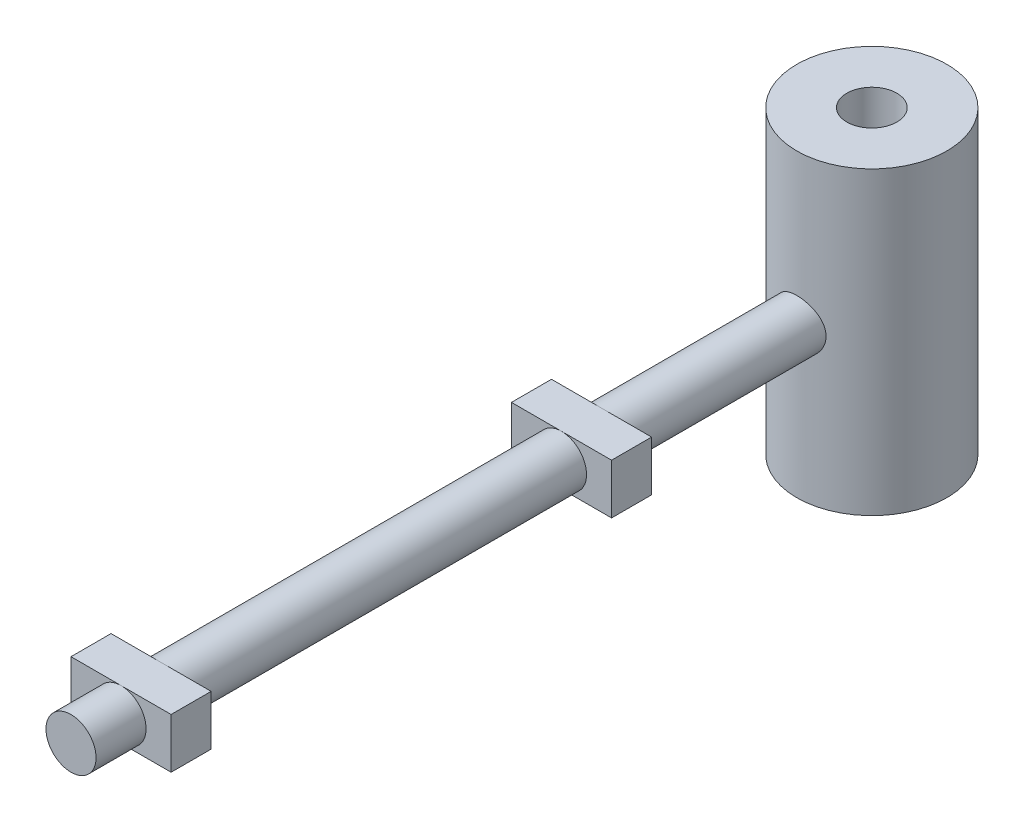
ISO-10303-21;
HEADER;
FILE_DESCRIPTION(('STEP AP214'),'2;1');
FILE_NAME('part.step','',(''),(''),'','','');
FILE_SCHEMA(('AUTOMOTIVE_DESIGN { 1 0 10303 214 1 1 1 1 }'));
ENDSEC;
DATA;
#1=APPLICATION_CONTEXT('core data for automotive mechanical design processes');
#2=APPLICATION_PROTOCOL_DEFINITION('international standard','automotive_design',2000,#1);
#3=PRODUCT_CONTEXT('',#1,'mechanical');
#4=PRODUCT('Part','Part','',(#3));
#5=PRODUCT_RELATED_PRODUCT_CATEGORY('part','',(#4));
#6=PRODUCT_DEFINITION_FORMATION('','',#4);
#7=PRODUCT_DEFINITION_CONTEXT('part definition',#1,'design');
#8=PRODUCT_DEFINITION('design','',#6,#7);
#9=PRODUCT_DEFINITION_SHAPE('','',#8);
#10=(LENGTH_UNIT() NAMED_UNIT(*) SI_UNIT(.MILLI.,.METRE.));
#11=(NAMED_UNIT(*) PLANE_ANGLE_UNIT() SI_UNIT($,.RADIAN.));
#12=(NAMED_UNIT(*) SI_UNIT($,.STERADIAN.) SOLID_ANGLE_UNIT());
#13=UNCERTAINTY_MEASURE_WITH_UNIT(LENGTH_MEASURE(1.E-05),#10,'distance_accuracy_value','');
#14=(GEOMETRIC_REPRESENTATION_CONTEXT(3) GLOBAL_UNCERTAINTY_ASSIGNED_CONTEXT((#13)) GLOBAL_UNIT_ASSIGNED_CONTEXT((#10,
#11,#12)) REPRESENTATION_CONTEXT('',''));
#15=CARTESIAN_POINT('',(0.,0.,0.));
#16=DIRECTION('',(0.,0.,1.));
#17=DIRECTION('',(1.,0.,0.));
#18=AXIS2_PLACEMENT_3D('',#15,#16,#17);
#19=CARTESIAN_POINT('',(0.,0.,-75.));
#20=DIRECTION('',(0.,0.,1.));
#21=DIRECTION('',(1.,0.,0.));
#22=AXIS2_PLACEMENT_3D('',#19,#20,#21);
#23=CYLINDRICAL_SURFACE('',#22,2.5);
#24=CARTESIAN_POINT('',(0.,0.,-48.));
#25=DIRECTION('',(0.,0.,-1.));
#26=DIRECTION('',(-1.,0.,0.));
#27=AXIS2_PLACEMENT_3D('',#24,#25,#26);
#28=CIRCLE('',#27,2.5);
#29=CARTESIAN_POINT('',(0.,2.5,-48.));
#30=VERTEX_POINT('',#29);
#31=CARTESIAN_POINT('',(0.,-2.5,-48.));
#32=VERTEX_POINT('',#31);
#33=EDGE_CURVE('E140',#30,#32,#28,.T.);
#34=ORIENTED_EDGE('',*,*,#33,.T.);
#35=EDGE_CURVE('E41',#32,#30,#28,.T.);
#36=ORIENTED_EDGE('',*,*,#35,.T.);
#37=EDGE_LOOP('',(#34,#36));
#38=FACE_BOUND('',#37,.T.);
#39=CARTESIAN_POINT('',(2.5,0.,-67.9289321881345));
#40=CARTESIAN_POINT('',(2.50000064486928,-0.13617043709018,-67.9289326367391));
#41=CARTESIAN_POINT('',(2.48883695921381,-0.272336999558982,-67.9249557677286));
#42=CARTESIAN_POINT('',(2.44462782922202,-0.540636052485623,-67.9095606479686));
#43=CARTESIAN_POINT('',(2.41157878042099,-0.672767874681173,-67.8981411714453));
#44=CARTESIAN_POINT('',(2.32488871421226,-0.92906723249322,-67.8692949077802));
#45=CARTESIAN_POINT('',(2.27128805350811,-1.05324982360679,-67.851879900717));
#46=CARTESIAN_POINT('',(2.14515407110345,-1.2909001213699,-67.8130219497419));
#47=CARTESIAN_POINT('',(2.07261657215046,-1.40436545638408,-67.7915781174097));
#48=CARTESIAN_POINT('',(1.90762786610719,-1.62179990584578,-67.7461377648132));
#49=CARTESIAN_POINT('',(1.8145608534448,-1.72528857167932,-67.7220776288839));
#50=CARTESIAN_POINT('',(1.61246916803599,-1.9155170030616,-67.6746533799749));
#51=CARTESIAN_POINT('',(1.50344193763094,-2.00225407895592,-67.651289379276));
#52=CARTESIAN_POINT('',(1.26901126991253,-2.15869724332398,-67.607153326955));
#53=CARTESIAN_POINT('',(1.14325477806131,-2.2278999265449,-67.5864648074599));
#54=CARTESIAN_POINT('',(0.881078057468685,-2.34397896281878,-67.5507603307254));
#55=CARTESIAN_POINT('',(0.74466071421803,-2.39086133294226,-67.5357428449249));
#56=CARTESIAN_POINT('',(0.470072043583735,-2.45933963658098,-67.5135231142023));
#57=CARTESIAN_POINT('',(0.332126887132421,-2.48175861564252,-67.506067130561));
#58=CARTESIAN_POINT('',(0.0542446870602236,-2.50329073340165,-67.4989097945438));
#59=CARTESIAN_POINT('',(-0.0856918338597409,-2.50240987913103,-67.4992064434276));
#60=CARTESIAN_POINT('',(-0.357758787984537,-2.47788936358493,-67.5073490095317));
#61=CARTESIAN_POINT('',(-0.489980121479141,-2.45514367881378,-67.5148983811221));
#62=CARTESIAN_POINT('',(-0.748608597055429,-2.38901754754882,-67.5363258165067));
#63=CARTESIAN_POINT('',(-0.87501534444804,-2.34563570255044,-67.5502043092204));
#64=CARTESIAN_POINT('',(-1.12038118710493,-2.23894670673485,-67.5831082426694));
#65=CARTESIAN_POINT('',(-1.23922055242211,-2.17538515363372,-67.6021989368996));
#66=CARTESIAN_POINT('',(-1.46481081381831,-2.03035073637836,-67.643540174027));
#67=CARTESIAN_POINT('',(-1.57155833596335,-1.94887289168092,-67.6657915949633));
#68=CARTESIAN_POINT('',(-1.77525216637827,-1.76581401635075,-67.7123452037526));
#69=CARTESIAN_POINT('',(-1.87150039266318,-1.6634671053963,-67.7366946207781));
#70=CARTESIAN_POINT('',(-2.04569314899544,-1.44387818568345,-67.7838166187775));
#71=CARTESIAN_POINT('',(-2.12363485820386,-1.32663388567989,-67.8065889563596));
#72=CARTESIAN_POINT('',(-2.25996863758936,-1.0783659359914,-67.8482368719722));
#73=CARTESIAN_POINT('',(-2.31806615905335,-0.947169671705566,-67.8670522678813));
#74=CARTESIAN_POINT('',(-2.41110798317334,-0.676071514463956,-67.8979587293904));
#75=CARTESIAN_POINT('',(-2.44606198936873,-0.536173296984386,-67.9100526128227));
#76=CARTESIAN_POINT('',(-2.4904032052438,-0.258404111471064,-67.9255090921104));
#77=CARTESIAN_POINT('',(-2.50087273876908,-0.12072643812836,-67.9292409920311));
#78=CARTESIAN_POINT('',(-2.4990135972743,0.154440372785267,-67.9285831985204));
#79=CARTESIAN_POINT('',(-2.48668906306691,0.291929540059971,-67.9241949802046));
#80=CARTESIAN_POINT('',(-2.44056412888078,0.557892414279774,-67.9081595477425));
#81=CARTESIAN_POINT('',(-2.40751598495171,0.686513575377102,-67.896766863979));
#82=CARTESIAN_POINT('',(-2.32178465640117,0.936359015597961,-67.8682861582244));
#83=CARTESIAN_POINT('',(-2.26909799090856,1.05758197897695,-67.851197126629));
#84=CARTESIAN_POINT('',(-2.14368585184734,1.29345105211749,-67.8125780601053));
#85=CARTESIAN_POINT('',(-2.07037779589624,1.4077666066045,-67.7909243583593));
#86=CARTESIAN_POINT('',(-1.9064640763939,1.6228651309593,-67.7458557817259));
#87=CARTESIAN_POINT('',(-1.81585331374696,1.72364409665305,-67.7224403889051));
#88=CARTESIAN_POINT('',(-1.61472926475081,1.9138199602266,-67.6751240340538));
#89=CARTESIAN_POINT('',(-1.50346817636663,2.00243597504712,-67.6512539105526));
#90=CARTESIAN_POINT('',(-1.26706822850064,2.15979035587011,-67.6068287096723));
#91=CARTESIAN_POINT('',(-1.14192986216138,2.22852942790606,-67.5862735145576));
#92=CARTESIAN_POINT('',(-0.88194965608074,2.34355026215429,-67.5508898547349));
#93=CARTESIAN_POINT('',(-0.747177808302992,2.38997819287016,-67.5360242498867));
#94=CARTESIAN_POINT('',(-0.471146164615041,2.45931935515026,-67.5135347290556));
#95=CARTESIAN_POINT('',(-0.329888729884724,2.48224107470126,-67.5059081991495));
#96=CARTESIAN_POINT('',(-0.0520383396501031,2.50315519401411,-67.4989534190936));
#97=CARTESIAN_POINT('',(0.0844618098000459,2.50226863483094,-67.499251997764));
#98=CARTESIAN_POINT('',(0.355277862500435,2.47835672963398,-67.507195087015));
#99=CARTESIAN_POINT('',(0.489593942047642,2.45533317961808,-67.5148390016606));
#100=CARTESIAN_POINT('',(0.750105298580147,2.38854441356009,-67.5364771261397));
#101=CARTESIAN_POINT('',(0.876395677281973,2.34511446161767,-67.5503685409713));
#102=CARTESIAN_POINT('',(1.11994587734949,2.23905617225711,-67.5830709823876));
#103=CARTESIAN_POINT('',(1.23720406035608,2.17642436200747,-67.6018828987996));
#104=CARTESIAN_POINT('',(1.46408504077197,2.03107621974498,-67.643353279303));
#105=CARTESIAN_POINT('',(1.57326562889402,1.9477032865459,-67.6661281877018));
#106=CARTESIAN_POINT('',(1.77645256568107,1.76435652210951,-67.712675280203));
#107=CARTESIAN_POINT('',(1.87045405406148,1.66437739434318,-67.7364477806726));
#108=CARTESIAN_POINT('',(2.0443545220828,1.44597661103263,-67.78341800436));
#109=CARTESIAN_POINT('',(2.12355741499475,1.3269862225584,-67.8065568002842));
#110=CARTESIAN_POINT('',(2.26078585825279,1.07666393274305,-67.8484951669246));
#111=CARTESIAN_POINT('',(2.31881694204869,0.945335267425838,-67.8672958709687));
#112=CARTESIAN_POINT('',(2.40960957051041,0.68009543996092,-67.8974666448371));
#113=CARTESIAN_POINT('',(2.4433947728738,0.546569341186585,-67.9091341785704));
#114=CARTESIAN_POINT('',(2.48858580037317,0.275359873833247,-67.924865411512));
#115=CARTESIAN_POINT('',(2.49999934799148,0.137677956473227,-67.9289317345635));
#116=CARTESIAN_POINT('',(2.5,0.,-67.9289321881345));
#117=B_SPLINE_CURVE_WITH_KNOTS('',3,(#39,#40,#41,#42,#43,#44,#45,#46,#47,#48,#49,#50,#51,#52,
#53,#54,#55,#56,#57,#58,#59,#60,#61,#62,#63,#64,#65,#66,#67,#68,#69,#70,#71,#72,#73,#74,#75,#76,
#77,#78,#79,#80,#81,#82,#83,#84,#85,#86,#87,#88,#89,#90,#91,#92,#93,#94,#95,#96,#97,#98,#99,
#100,#101,#102,#103,#104,#105,#106,#107,#108,#109,#110,#111,#112,#113,#114,#115,#116),
.UNSPECIFIED.,.T.,.F.,(4,2,2,2,2,2,2,2,2,2,2,2,2,2,2,2,2,2,2,2,2,2,2,2,2,2,2,2,2,2,2,2,2,2,2,2,
2,2,4),(0.,0.40800146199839,0.816070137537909,1.22334156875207,1.6307029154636,2.0525334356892,
2.4744316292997,2.90733765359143,3.34012690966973,3.75785796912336,4.17548133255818,
4.57672512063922,4.97799610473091,5.38454137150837,5.79119979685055,6.21700435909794,
6.64287449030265,7.07481599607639,7.50657628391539,7.91885728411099,8.33106339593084,
8.7291098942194,9.12722697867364,9.53797144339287,9.94883714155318,10.3794702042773,
10.8100879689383,11.2378447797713,11.6654470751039,12.0729521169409,12.4804241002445,
12.8814239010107,13.2824962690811,13.6983879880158,14.1144126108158,14.5467225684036,
14.9789194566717,15.3915803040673,15.8040986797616),.UNSPECIFIED.);
#118=CARTESIAN_POINT('',(2.5,0.,-67.9289321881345));
#119=VERTEX_POINT('',#118);
#120=EDGE_CURVE('E11',#119,#119,#117,.T.);
#121=ORIENTED_EDGE('',*,*,#120,.F.);
#122=EDGE_LOOP('',(#121));
#123=FACE_BOUND('',#122,.T.);
#124=ADVANCED_FACE('F32',(#38,#123),#23,.T.);
#125=CARTESIAN_POINT('',(5.,-2.5,-48.));
#126=DIRECTION('',(0.,0.,-1.));
#127=DIRECTION('',(-1.,0.,0.));
#128=AXIS2_PLACEMENT_3D('',#125,#126,#127);
#129=PLANE('',#128);
#130=ORIENTED_EDGE('',*,*,#33,.F.);
#131=DIRECTION('',(1.,0.,0.));
#132=VECTOR('',#131,1.);
#133=CARTESIAN_POINT('',(5.,2.5,-48.));
#134=LINE('',#133,#132);
#135=CARTESIAN_POINT('',(5.,2.5,-48.));
#136=VERTEX_POINT('',#135);
#137=EDGE_CURVE('E128',#30,#136,#134,.T.);
#138=ORIENTED_EDGE('',*,*,#137,.T.);
#139=DIRECTION('',(0.,-1.,0.));
#140=VECTOR('',#139,1.);
#141=CARTESIAN_POINT('',(5.,2.5,-48.));
#142=LINE('',#141,#140);
#143=CARTESIAN_POINT('',(5.,-2.5,-48.));
#144=VERTEX_POINT('',#143);
#145=EDGE_CURVE('E167',#136,#144,#142,.T.);
#146=ORIENTED_EDGE('',*,*,#145,.T.);
#147=DIRECTION('',(-1.,0.,0.));
#148=VECTOR('',#147,1.);
#149=CARTESIAN_POINT('',(5.,-2.5,-48.));
#150=LINE('',#149,#148);
#151=EDGE_CURVE('E142',#144,#32,#150,.T.);
#152=ORIENTED_EDGE('',*,*,#151,.T.);
#153=EDGE_LOOP('',(#130,#138,#146,#152));
#154=FACE_BOUND('',#153,.T.);
#155=ADVANCED_FACE('F141',(#154),#129,.T.);
#156=CARTESIAN_POINT('',(5.,2.5,-4.));
#157=DIRECTION('',(0.,0.,-1.));
#158=DIRECTION('',(-1.,0.,0.));
#159=AXIS2_PLACEMENT_3D('',#156,#157,#158);
#160=PLANE('',#159);
#161=CARTESIAN_POINT('',(0.,0.,-4.));
#162=DIRECTION('',(0.,0.,-1.));
#163=DIRECTION('',(-1.,0.,0.));
#164=AXIS2_PLACEMENT_3D('',#161,#162,#163);
#165=CIRCLE('',#164,2.5);
#166=CARTESIAN_POINT('',(0.,2.5,-4.));
#167=VERTEX_POINT('',#166);
#168=CARTESIAN_POINT('',(0.,-2.5,-4.));
#169=VERTEX_POINT('',#168);
#170=EDGE_CURVE('E152',#167,#169,#165,.T.);
#171=ORIENTED_EDGE('',*,*,#170,.F.);
#172=DIRECTION('',(1.,0.,0.));
#173=VECTOR('',#172,1.);
#174=CARTESIAN_POINT('',(5.,2.5,-4.));
#175=LINE('',#174,#173);
#176=CARTESIAN_POINT('',(5.,2.5,-4.));
#177=VERTEX_POINT('',#176);
#178=EDGE_CURVE('E205',#167,#177,#175,.T.);
#179=ORIENTED_EDGE('',*,*,#178,.T.);
#180=DIRECTION('',(0.,-1.,0.));
#181=VECTOR('',#180,1.);
#182=CARTESIAN_POINT('',(5.,2.5,-4.));
#183=LINE('',#182,#181);
#184=CARTESIAN_POINT('',(5.,-2.5,-4.));
#185=VERTEX_POINT('',#184);
#186=EDGE_CURVE('E196',#177,#185,#183,.T.);
#187=ORIENTED_EDGE('',*,*,#186,.T.);
#188=DIRECTION('',(-1.,0.,0.));
#189=VECTOR('',#188,1.);
#190=CARTESIAN_POINT('',(5.,-2.5,-4.));
#191=LINE('',#190,#189);
#192=EDGE_CURVE('E200',#185,#169,#191,.T.);
#193=ORIENTED_EDGE('',*,*,#192,.T.);
#194=EDGE_LOOP('',(#171,#179,#187,#193));
#195=FACE_BOUND('',#194,.T.);
#196=ADVANCED_FACE('F255',(#195),#160,.T.);
#197=CARTESIAN_POINT('',(0.,0.,5.));
#198=DIRECTION('',(0.,0.,-1.));
#199=DIRECTION('',(-1.,0.,0.));
#200=AXIS2_PLACEMENT_3D('',#197,#198,#199);
#201=CYLINDRICAL_SURFACE('',#200,2.5);
#202=CARTESIAN_POINT('',(0.,0.,5.));
#203=DIRECTION('',(0.,0.,1.));
#204=DIRECTION('',(1.,0.,0.));
#205=AXIS2_PLACEMENT_3D('',#202,#203,#204);
#206=CIRCLE('',#205,2.5);
#207=CARTESIAN_POINT('',(2.5,0.,5.));
#208=VERTEX_POINT('',#207);
#209=EDGE_CURVE('E150',#208,#208,#206,.T.);
#210=ORIENTED_EDGE('',*,*,#209,.F.);
#211=EDGE_LOOP('',(#210));
#212=FACE_BOUND('',#211,.T.);
#213=CARTESIAN_POINT('',(0.,0.,0.));
#214=DIRECTION('',(0.,0.,1.));
#215=DIRECTION('',(1.,0.,0.));
#216=AXIS2_PLACEMENT_3D('',#213,#214,#215);
#217=CIRCLE('',#216,2.5);
#218=CARTESIAN_POINT('',(0.,2.5,0.));
#219=VERTEX_POINT('',#218);
#220=CARTESIAN_POINT('',(0.,-2.5,0.));
#221=VERTEX_POINT('',#220);
#222=EDGE_CURVE('E221',#219,#221,#217,.T.);
#223=ORIENTED_EDGE('',*,*,#222,.T.);
#224=EDGE_CURVE('E220',#221,#219,#217,.T.);
#225=ORIENTED_EDGE('',*,*,#224,.T.);
#226=EDGE_LOOP('',(#223,#225));
#227=FACE_BOUND('',#226,.T.);
#228=ADVANCED_FACE('F34',(#212,#227),#201,.T.);
#229=CARTESIAN_POINT('',(0.,0.,5.));
#230=DIRECTION('',(0.,0.,1.));
#231=DIRECTION('',(1.,0.,0.));
#232=AXIS2_PLACEMENT_3D('',#229,#230,#231);
#233=PLANE('',#232);
#234=ORIENTED_EDGE('',*,*,#209,.T.);
#235=EDGE_LOOP('',(#234));
#236=FACE_BOUND('',#235,.T.);
#237=ADVANCED_FACE('F311',(#236),#233,.T.);
#238=CARTESIAN_POINT('',(5.,2.5,0.));
#239=DIRECTION('',(0.,0.,-1.));
#240=DIRECTION('',(-1.,0.,0.));
#241=AXIS2_PLACEMENT_3D('',#238,#239,#240);
#242=PLANE('',#241);
#243=ORIENTED_EDGE('',*,*,#222,.F.);
#244=DIRECTION('',(1.,0.,0.));
#245=VECTOR('',#244,1.);
#246=CARTESIAN_POINT('',(5.,2.5,0.));
#247=LINE('',#246,#245);
#248=CARTESIAN_POINT('',(-5.,2.5,0.));
#249=VERTEX_POINT('',#248);
#250=EDGE_CURVE('E194',#249,#219,#247,.T.);
#251=ORIENTED_EDGE('',*,*,#250,.F.);
#252=DIRECTION('',(0.,1.,0.));
#253=VECTOR('',#252,1.);
#254=CARTESIAN_POINT('',(-5.,2.5,0.));
#255=LINE('',#254,#253);
#256=CARTESIAN_POINT('',(-5.,-2.5,0.));
#257=VERTEX_POINT('',#256);
#258=EDGE_CURVE('E191',#257,#249,#255,.T.);
#259=ORIENTED_EDGE('',*,*,#258,.F.);
#260=DIRECTION('',(-1.,0.,0.));
#261=VECTOR('',#260,1.);
#262=CARTESIAN_POINT('',(5.,-2.5,0.));
#263=LINE('',#262,#261);
#264=EDGE_CURVE('E187',#221,#257,#263,.T.);
#265=ORIENTED_EDGE('',*,*,#264,.F.);
#266=EDGE_LOOP('',(#243,#251,#259,#265));
#267=FACE_BOUND('',#266,.T.);
#268=ADVANCED_FACE('F292',(#267),#242,.F.);
#269=CARTESIAN_POINT('',(5.,2.5,-4.));
#270=DIRECTION('',(-1.,0.,0.));
#271=DIRECTION('',(0.,-1.,0.));
#272=AXIS2_PLACEMENT_3D('',#269,#270,#271);
#273=PLANE('',#272);
#274=DIRECTION('',(0.,-1.,0.));
#275=VECTOR('',#274,1.);
#276=CARTESIAN_POINT('',(5.,2.5,0.));
#277=LINE('',#276,#275);
#278=CARTESIAN_POINT('',(5.,2.5,0.));
#279=VERTEX_POINT('',#278);
#280=CARTESIAN_POINT('',(5.,-2.5,0.));
#281=VERTEX_POINT('',#280);
#282=EDGE_CURVE('E184',#279,#281,#277,.T.);
#283=ORIENTED_EDGE('',*,*,#282,.T.);
#284=DIRECTION('',(0.,0.,1.));
#285=VECTOR('',#284,1.);
#286=CARTESIAN_POINT('',(5.,-2.5,-4.));
#287=LINE('',#286,#285);
#288=EDGE_CURVE('E217',#185,#281,#287,.T.);
#289=ORIENTED_EDGE('',*,*,#288,.F.);
#290=ORIENTED_EDGE('',*,*,#186,.F.);
#291=DIRECTION('',(0.,0.,1.));
#292=VECTOR('',#291,1.);
#293=CARTESIAN_POINT('',(5.,2.5,-4.));
#294=LINE('',#293,#292);
#295=EDGE_CURVE('E208',#177,#279,#294,.T.);
#296=ORIENTED_EDGE('',*,*,#295,.T.);
#297=EDGE_LOOP('',(#283,#289,#290,#296));
#298=FACE_BOUND('',#297,.T.);
#299=ADVANCED_FACE('F307',(#298),#273,.F.);
#300=CARTESIAN_POINT('',(5.,-2.5,-4.));
#301=DIRECTION('',(0.,1.,0.));
#302=DIRECTION('',(-1.,0.,0.));
#303=AXIS2_PLACEMENT_3D('',#300,#301,#302);
#304=PLANE('',#303);
#305=EDGE_CURVE('E188',#281,#221,#263,.T.);
#306=ORIENTED_EDGE('',*,*,#305,.T.);
#307=ORIENTED_EDGE('',*,*,#264,.T.);
#308=DIRECTION('',(0.,0.,1.));
#309=VECTOR('',#308,1.);
#310=CARTESIAN_POINT('',(-5.,-2.5,-4.));
#311=LINE('',#310,#309);
#312=CARTESIAN_POINT('',(-5.,-2.5,-4.));
#313=VERTEX_POINT('',#312);
#314=EDGE_CURVE('E214',#313,#257,#311,.T.);
#315=ORIENTED_EDGE('',*,*,#314,.F.);
#316=EDGE_CURVE('E199',#169,#313,#191,.T.);
#317=ORIENTED_EDGE('',*,*,#316,.F.);
#318=ORIENTED_EDGE('',*,*,#192,.F.);
#319=ORIENTED_EDGE('',*,*,#288,.T.);
#320=EDGE_LOOP('',(#306,#307,#315,#317,#318,#319));
#321=FACE_BOUND('',#320,.T.);
#322=ADVANCED_FACE('F303',(#321),#304,.F.);
#323=CARTESIAN_POINT('',(-5.,2.5,-4.));
#324=DIRECTION('',(1.,0.,0.));
#325=DIRECTION('',(0.,1.,0.));
#326=AXIS2_PLACEMENT_3D('',#323,#324,#325);
#327=PLANE('',#326);
#328=ORIENTED_EDGE('',*,*,#258,.T.);
#329=DIRECTION('',(0.,0.,1.));
#330=VECTOR('',#329,1.);
#331=CARTESIAN_POINT('',(-5.,2.5,-4.));
#332=LINE('',#331,#330);
#333=CARTESIAN_POINT('',(-5.,2.5,-4.));
#334=VERTEX_POINT('',#333);
#335=EDGE_CURVE('E211',#334,#249,#332,.T.);
#336=ORIENTED_EDGE('',*,*,#335,.F.);
#337=DIRECTION('',(0.,1.,0.));
#338=VECTOR('',#337,1.);
#339=CARTESIAN_POINT('',(-5.,2.5,-4.));
#340=LINE('',#339,#338);
#341=EDGE_CURVE('E203',#313,#334,#340,.T.);
#342=ORIENTED_EDGE('',*,*,#341,.F.);
#343=ORIENTED_EDGE('',*,*,#314,.T.);
#344=EDGE_LOOP('',(#328,#336,#342,#343));
#345=FACE_BOUND('',#344,.T.);
#346=ADVANCED_FACE('F299',(#345),#327,.F.);
#347=CARTESIAN_POINT('',(5.,2.5,-4.));
#348=DIRECTION('',(0.,-1.,0.));
#349=DIRECTION('',(0.,0.,-1.));
#350=AXIS2_PLACEMENT_3D('',#347,#348,#349);
#351=PLANE('',#350);
#352=ORIENTED_EDGE('',*,*,#250,.T.);
#353=EDGE_CURVE('E193',#219,#279,#247,.T.);
#354=ORIENTED_EDGE('',*,*,#353,.T.);
#355=ORIENTED_EDGE('',*,*,#295,.F.);
#356=ORIENTED_EDGE('',*,*,#178,.F.);
#357=EDGE_CURVE('E206',#334,#167,#175,.T.);
#358=ORIENTED_EDGE('',*,*,#357,.F.);
#359=ORIENTED_EDGE('',*,*,#335,.T.);
#360=EDGE_LOOP('',(#352,#354,#355,#356,#358,#359));
#361=FACE_BOUND('',#360,.T.);
#362=ADVANCED_FACE('F295',(#361),#351,.F.);
#363=EDGE_CURVE('E148',#169,#167,#165,.T.);
#364=ORIENTED_EDGE('',*,*,#363,.F.);
#365=ORIENTED_EDGE('',*,*,#316,.T.);
#366=ORIENTED_EDGE('',*,*,#341,.T.);
#367=ORIENTED_EDGE('',*,*,#357,.T.);
#368=EDGE_LOOP('',(#364,#365,#366,#367));
#369=FACE_BOUND('',#368,.T.);
#370=ADVANCED_FACE('F262',(#369),#160,.T.);
#371=ORIENTED_EDGE('',*,*,#224,.F.);
#372=ORIENTED_EDGE('',*,*,#305,.F.);
#373=ORIENTED_EDGE('',*,*,#282,.F.);
#374=ORIENTED_EDGE('',*,*,#353,.F.);
#375=EDGE_LOOP('',(#371,#372,#373,#374));
#376=FACE_BOUND('',#375,.T.);
#377=ADVANCED_FACE('F288',(#376),#242,.F.);
#378=CARTESIAN_POINT('',(0.,0.,-44.));
#379=DIRECTION('',(0.,0.,1.));
#380=DIRECTION('',(1.,0.,0.));
#381=AXIS2_PLACEMENT_3D('',#378,#379,#380);
#382=CYLINDRICAL_SURFACE('',#381,2.5);
#383=ORIENTED_EDGE('',*,*,#170,.T.);
#384=ORIENTED_EDGE('',*,*,#363,.T.);
#385=EDGE_LOOP('',(#383,#384));
#386=FACE_BOUND('',#385,.T.);
#387=CARTESIAN_POINT('',(0.,0.,-44.));
#388=DIRECTION('',(0.,0.,-1.));
#389=DIRECTION('',(-1.,0.,0.));
#390=AXIS2_PLACEMENT_3D('',#387,#388,#389);
#391=CIRCLE('',#390,2.5);
#392=CARTESIAN_POINT('',(0.,2.5,-44.));
#393=VERTEX_POINT('',#392);
#394=CARTESIAN_POINT('',(0.,-2.5,-44.));
#395=VERTEX_POINT('',#394);
#396=EDGE_CURVE('E182',#393,#395,#391,.T.);
#397=ORIENTED_EDGE('',*,*,#396,.F.);
#398=EDGE_CURVE('E54',#395,#393,#391,.T.);
#399=ORIENTED_EDGE('',*,*,#398,.F.);
#400=EDGE_LOOP('',(#397,#399));
#401=FACE_BOUND('',#400,.T.);
#402=ADVANCED_FACE('F284',(#386,#401),#382,.T.);
#403=CARTESIAN_POINT('',(5.,-2.5,-44.));
#404=DIRECTION('',(0.,0.,-1.));
#405=DIRECTION('',(-1.,0.,0.));
#406=AXIS2_PLACEMENT_3D('',#403,#404,#405);
#407=PLANE('',#406);
#408=DIRECTION('',(1.,0.,0.));
#409=VECTOR('',#408,1.);
#410=CARTESIAN_POINT('',(5.,2.5,-44.));
#411=LINE('',#410,#409);
#412=CARTESIAN_POINT('',(5.,2.5,-44.));
#413=VERTEX_POINT('',#412);
#414=EDGE_CURVE('E164',#393,#413,#411,.T.);
#415=ORIENTED_EDGE('',*,*,#414,.F.);
#416=ORIENTED_EDGE('',*,*,#396,.T.);
#417=DIRECTION('',(-1.,0.,0.));
#418=VECTOR('',#417,1.);
#419=CARTESIAN_POINT('',(5.,-2.5,-44.));
#420=LINE('',#419,#418);
#421=CARTESIAN_POINT('',(5.,-2.5,-44.));
#422=VERTEX_POINT('',#421);
#423=EDGE_CURVE('E159',#422,#395,#420,.T.);
#424=ORIENTED_EDGE('',*,*,#423,.F.);
#425=DIRECTION('',(0.,-1.,0.));
#426=VECTOR('',#425,1.);
#427=CARTESIAN_POINT('',(5.,2.5,-44.));
#428=LINE('',#427,#426);
#429=EDGE_CURVE('E144',#413,#422,#428,.T.);
#430=ORIENTED_EDGE('',*,*,#429,.F.);
#431=EDGE_LOOP('',(#415,#416,#424,#430));
#432=FACE_BOUND('',#431,.T.);
#433=ADVANCED_FACE('F287',(#432),#407,.F.);
#434=CARTESIAN_POINT('',(-5.,-2.5,-44.));
#435=VERTEX_POINT('',#434);
#436=EDGE_CURVE('E158',#395,#435,#420,.T.);
#437=ORIENTED_EDGE('',*,*,#436,.F.);
#438=ORIENTED_EDGE('',*,*,#398,.T.);
#439=CARTESIAN_POINT('',(-5.,2.5,-44.));
#440=VERTEX_POINT('',#439);
#441=EDGE_CURVE('E165',#440,#393,#411,.T.);
#442=ORIENTED_EDGE('',*,*,#441,.F.);
#443=DIRECTION('',(0.,1.,0.));
#444=VECTOR('',#443,1.);
#445=CARTESIAN_POINT('',(-5.,2.5,-44.));
#446=LINE('',#445,#444);
#447=EDGE_CURVE('E162',#435,#440,#446,.T.);
#448=ORIENTED_EDGE('',*,*,#447,.F.);
#449=EDGE_LOOP('',(#437,#438,#442,#448));
#450=FACE_BOUND('',#449,.T.);
#451=ADVANCED_FACE('F282',(#450),#407,.F.);
#452=CARTESIAN_POINT('',(5.,2.5,-48.));
#453=DIRECTION('',(-1.,0.,0.));
#454=DIRECTION('',(0.,0.,1.));
#455=AXIS2_PLACEMENT_3D('',#452,#453,#454);
#456=PLANE('',#455);
#457=ORIENTED_EDGE('',*,*,#429,.T.);
#458=DIRECTION('',(0.,0.,1.));
#459=VECTOR('',#458,1.);
#460=CARTESIAN_POINT('',(5.,-2.5,-48.));
#461=LINE('',#460,#459);
#462=EDGE_CURVE('E178',#144,#422,#461,.T.);
#463=ORIENTED_EDGE('',*,*,#462,.F.);
#464=ORIENTED_EDGE('',*,*,#145,.F.);
#465=DIRECTION('',(0.,0.,1.));
#466=VECTOR('',#465,1.);
#467=CARTESIAN_POINT('',(5.,2.5,-48.));
#468=LINE('',#467,#466);
#469=EDGE_CURVE('E127',#136,#413,#468,.T.);
#470=ORIENTED_EDGE('',*,*,#469,.T.);
#471=EDGE_LOOP('',(#457,#463,#464,#470));
#472=FACE_BOUND('',#471,.T.);
#473=ADVANCED_FACE('F278',(#472),#456,.F.);
#474=CARTESIAN_POINT('',(5.,-2.5,-48.));
#475=DIRECTION('',(0.,1.,0.));
#476=DIRECTION('',(0.,0.,1.));
#477=AXIS2_PLACEMENT_3D('',#474,#475,#476);
#478=PLANE('',#477);
#479=ORIENTED_EDGE('',*,*,#423,.T.);
#480=ORIENTED_EDGE('',*,*,#436,.T.);
#481=DIRECTION('',(0.,0.,1.));
#482=VECTOR('',#481,1.);
#483=CARTESIAN_POINT('',(-5.,-2.5,-48.));
#484=LINE('',#483,#482);
#485=CARTESIAN_POINT('',(-5.,-2.5,-48.));
#486=VERTEX_POINT('',#485);
#487=EDGE_CURVE('E175',#486,#435,#484,.T.);
#488=ORIENTED_EDGE('',*,*,#487,.F.);
#489=EDGE_CURVE('E169',#32,#486,#150,.T.);
#490=ORIENTED_EDGE('',*,*,#489,.F.);
#491=ORIENTED_EDGE('',*,*,#151,.F.);
#492=ORIENTED_EDGE('',*,*,#462,.T.);
#493=EDGE_LOOP('',(#479,#480,#488,#490,#491,#492));
#494=FACE_BOUND('',#493,.T.);
#495=ADVANCED_FACE('F272',(#494),#478,.F.);
#496=CARTESIAN_POINT('',(-5.,2.5,-48.));
#497=DIRECTION('',(1.,0.,0.));
#498=DIRECTION('',(0.,0.,-1.));
#499=AXIS2_PLACEMENT_3D('',#496,#497,#498);
#500=PLANE('',#499);
#501=ORIENTED_EDGE('',*,*,#447,.T.);
#502=DIRECTION('',(0.,0.,1.));
#503=VECTOR('',#502,1.);
#504=CARTESIAN_POINT('',(-5.,2.5,-48.));
#505=LINE('',#504,#503);
#506=CARTESIAN_POINT('',(-5.,2.5,-48.));
#507=VERTEX_POINT('',#506);
#508=EDGE_CURVE('E173',#507,#440,#505,.T.);
#509=ORIENTED_EDGE('',*,*,#508,.F.);
#510=DIRECTION('',(0.,1.,0.));
#511=VECTOR('',#510,1.);
#512=CARTESIAN_POINT('',(-5.,2.5,-48.));
#513=LINE('',#512,#511);
#514=EDGE_CURVE('E123',#486,#507,#513,.T.);
#515=ORIENTED_EDGE('',*,*,#514,.F.);
#516=ORIENTED_EDGE('',*,*,#487,.T.);
#517=EDGE_LOOP('',(#501,#509,#515,#516));
#518=FACE_BOUND('',#517,.T.);
#519=ADVANCED_FACE('F268',(#518),#500,.F.);
#520=CARTESIAN_POINT('',(5.,2.5,-48.));
#521=DIRECTION('',(0.,-1.,0.));
#522=DIRECTION('',(0.,0.,-1.));
#523=AXIS2_PLACEMENT_3D('',#520,#521,#522);
#524=PLANE('',#523);
#525=ORIENTED_EDGE('',*,*,#441,.T.);
#526=ORIENTED_EDGE('',*,*,#414,.T.);
#527=ORIENTED_EDGE('',*,*,#469,.F.);
#528=ORIENTED_EDGE('',*,*,#137,.F.);
#529=EDGE_CURVE('E119',#507,#30,#134,.T.);
#530=ORIENTED_EDGE('',*,*,#529,.F.);
#531=ORIENTED_EDGE('',*,*,#508,.T.);
#532=EDGE_LOOP('',(#525,#526,#527,#528,#530,#531));
#533=FACE_BOUND('',#532,.T.);
#534=ADVANCED_FACE('F133',(#533),#524,.F.);
#535=ORIENTED_EDGE('',*,*,#35,.F.);
#536=ORIENTED_EDGE('',*,*,#489,.T.);
#537=ORIENTED_EDGE('',*,*,#514,.T.);
#538=ORIENTED_EDGE('',*,*,#529,.T.);
#539=EDGE_LOOP('',(#535,#536,#537,#538));
#540=FACE_BOUND('',#539,.T.);
#541=ADVANCED_FACE('F121',(#540),#129,.T.);
#542=CARTESIAN_POINT('',(0.,15.,-75.));
#543=DIRECTION('',(0.,-1.,0.));
#544=DIRECTION('',(0.,0.,-1.));
#545=AXIS2_PLACEMENT_3D('',#542,#543,#544);
#546=CYLINDRICAL_SURFACE('',#545,7.50000000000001);
#547=CARTESIAN_POINT('',(0.,-15.,-75.));
#548=DIRECTION('',(0.,1.,0.));
#549=DIRECTION('',(0.,0.,1.));
#550=AXIS2_PLACEMENT_3D('',#547,#548,#549);
#551=CIRCLE('',#550,7.50000000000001);
#552=CARTESIAN_POINT('',(0.,-15.,-67.5));
#553=VERTEX_POINT('',#552);
#554=EDGE_CURVE('E492',#553,#553,#551,.T.);
#555=ORIENTED_EDGE('',*,*,#554,.T.);
#556=EDGE_LOOP('',(#555));
#557=FACE_BOUND('',#556,.T.);
#558=CARTESIAN_POINT('',(0.,15.,-75.));
#559=DIRECTION('',(0.,1.,0.));
#560=DIRECTION('',(0.,0.,1.));
#561=AXIS2_PLACEMENT_3D('',#558,#559,#560);
#562=CIRCLE('',#561,7.50000000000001);
#563=CARTESIAN_POINT('',(0.,15.,-67.5));
#564=VERTEX_POINT('',#563);
#565=EDGE_CURVE('E145',#564,#564,#562,.T.);
#566=ORIENTED_EDGE('',*,*,#565,.F.);
#567=EDGE_LOOP('',(#566));
#568=FACE_BOUND('',#567,.T.);
#569=ORIENTED_EDGE('',*,*,#120,.T.);
#570=EDGE_LOOP('',(#569));
#571=FACE_BOUND('',#570,.T.);
#572=ADVANCED_FACE('F231',(#557,#568,#571),#546,.T.);
#573=CARTESIAN_POINT('',(0.,15.,-75.));
#574=DIRECTION('',(0.,1.,0.));
#575=DIRECTION('',(0.,0.,1.));
#576=AXIS2_PLACEMENT_3D('',#573,#574,#575);
#577=PLANE('',#576);
#578=CARTESIAN_POINT('',(0.,15.,-75.));
#579=DIRECTION('',(0.,1.,0.));
#580=DIRECTION('',(0.,0.,1.));
#581=AXIS2_PLACEMENT_3D('',#578,#579,#580);
#582=CIRCLE('',#581,2.5);
#583=CARTESIAN_POINT('',(0.,15.,-72.5));
#584=VERTEX_POINT('',#583);
#585=EDGE_CURVE('E489',#584,#584,#582,.T.);
#586=ORIENTED_EDGE('',*,*,#585,.F.);
#587=EDGE_LOOP('',(#586));
#588=FACE_BOUND('',#587,.T.);
#589=ORIENTED_EDGE('',*,*,#565,.T.);
#590=EDGE_LOOP('',(#589));
#591=FACE_BOUND('',#590,.T.);
#592=ADVANCED_FACE('F235',(#588,#591),#577,.T.);
#593=CARTESIAN_POINT('',(0.,-15.,-75.));
#594=DIRECTION('',(0.,1.,0.));
#595=DIRECTION('',(0.,0.,1.));
#596=AXIS2_PLACEMENT_3D('',#593,#594,#595);
#597=PLANE('',#596);
#598=CARTESIAN_POINT('',(0.,-15.,-75.));
#599=DIRECTION('',(0.,1.,0.));
#600=DIRECTION('',(0.,0.,1.));
#601=AXIS2_PLACEMENT_3D('',#598,#599,#600);
#602=CIRCLE('',#601,2.5);
#603=CARTESIAN_POINT('',(0.,-15.,-72.5));
#604=VERTEX_POINT('',#603);
#605=EDGE_CURVE('E36',#604,#604,#602,.T.);
#606=ORIENTED_EDGE('',*,*,#605,.T.);
#607=EDGE_LOOP('',(#606));
#608=FACE_BOUND('',#607,.T.);
#609=ORIENTED_EDGE('',*,*,#554,.F.);
#610=EDGE_LOOP('',(#609));
#611=FACE_BOUND('',#610,.T.);
#612=ADVANCED_FACE('F239',(#608,#611),#597,.F.);
#613=CARTESIAN_POINT('',(0.,-18.,-75.));
#614=DIRECTION('',(0.,1.,0.));
#615=DIRECTION('',(0.,0.,1.));
#616=AXIS2_PLACEMENT_3D('',#613,#614,#615);
#617=CYLINDRICAL_SURFACE('',#616,2.5);
#618=ORIENTED_EDGE('',*,*,#585,.T.);
#619=EDGE_LOOP('',(#618));
#620=FACE_BOUND('',#619,.T.);
#621=ORIENTED_EDGE('',*,*,#605,.F.);
#622=EDGE_LOOP('',(#621));
#623=FACE_BOUND('',#622,.T.);
#624=ADVANCED_FACE('F243',(#620,#623),#617,.F.);
#625=CLOSED_SHELL('',(#124,#155,#196,#228,#237,#268,#299,#322,#346,#362,#370,#377,#402,#433,
#451,#473,#495,#519,#534,#541,#572,#592,#612,#624));
#626=MANIFOLD_SOLID_BREP('B2',#625);
#627=ADVANCED_BREP_SHAPE_REPRESENTATION('',(#18,#626),#14);
#628=SHAPE_DEFINITION_REPRESENTATION(#9,#627);
ENDSEC;
END-ISO-10303-21;
